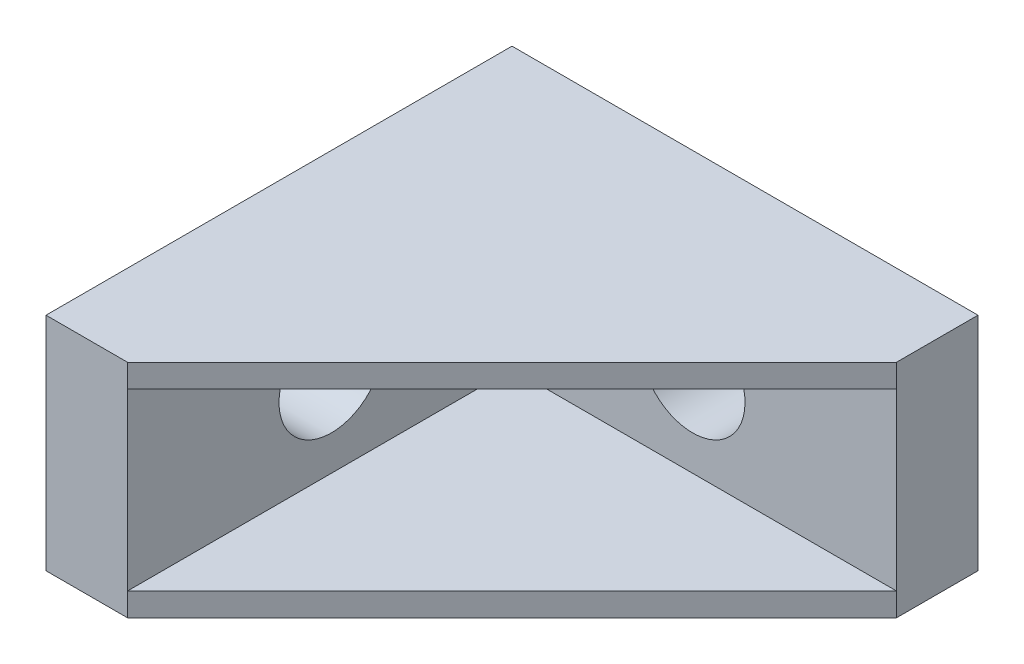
ISO-10303-21;
HEADER;
FILE_DESCRIPTION(('STEP AP214'),'2;1');
FILE_NAME('part.step','',(''),(''),'','','');
FILE_SCHEMA(('AUTOMOTIVE_DESIGN { 1 0 10303 214 1 1 1 1 }'));
ENDSEC;
DATA;
#1=APPLICATION_CONTEXT('core data for automotive mechanical design processes');
#2=APPLICATION_PROTOCOL_DEFINITION('international standard','automotive_design',2000,#1);
#3=PRODUCT_CONTEXT('',#1,'mechanical');
#4=PRODUCT('Part','Part','',(#3));
#5=PRODUCT_RELATED_PRODUCT_CATEGORY('part','',(#4));
#6=PRODUCT_DEFINITION_FORMATION('','',#4);
#7=PRODUCT_DEFINITION_CONTEXT('part definition',#1,'design');
#8=PRODUCT_DEFINITION('design','',#6,#7);
#9=PRODUCT_DEFINITION_SHAPE('','',#8);
#10=(LENGTH_UNIT() NAMED_UNIT(*) SI_UNIT(.MILLI.,.METRE.));
#11=(NAMED_UNIT(*) PLANE_ANGLE_UNIT() SI_UNIT($,.RADIAN.));
#12=(NAMED_UNIT(*) SI_UNIT($,.STERADIAN.) SOLID_ANGLE_UNIT());
#13=UNCERTAINTY_MEASURE_WITH_UNIT(LENGTH_MEASURE(1.E-05),#10,'distance_accuracy_value','');
#14=(GEOMETRIC_REPRESENTATION_CONTEXT(3) GLOBAL_UNCERTAINTY_ASSIGNED_CONTEXT((#13)) GLOBAL_UNIT_ASSIGNED_CONTEXT((#10,
#11,#12)) REPRESENTATION_CONTEXT('',''));
#15=CARTESIAN_POINT('',(0.,0.,0.));
#16=DIRECTION('',(0.,0.,1.));
#17=DIRECTION('',(1.,0.,0.));
#18=AXIS2_PLACEMENT_3D('',#15,#16,#17);
#19=CARTESIAN_POINT('',(15.6482371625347,7.5,15.6482371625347));
#20=DIRECTION('',(0.,-1.,0.));
#21=DIRECTION('',(0.,0.,-1.));
#22=AXIS2_PLACEMENT_3D('',#19,#20,#21);
#23=PLANE('',#22);
#24=DIRECTION('',(-1.,0.,0.));
#25=VECTOR('',#24,1.);
#26=CARTESIAN_POINT('',(20.,7.5,7.));
#27=LINE('',#26,#25);
#28=CARTESIAN_POINT('',(7.,7.5,7.));
#29=VERTEX_POINT('',#28);
#30=CARTESIAN_POINT('',(40.,7.5,7.));
#31=VERTEX_POINT('',#30);
#32=EDGE_CURVE('E85',#29,#31,#27,.F.);
#33=ORIENTED_EDGE('',*,*,#32,.T.);
#34=DIRECTION('',(0.707106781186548,0.,-0.707106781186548));
#35=VECTOR('',#34,1.);
#36=CARTESIAN_POINT('',(7.,7.5,40.));
#37=LINE('',#36,#35);
#38=CARTESIAN_POINT('',(7.,7.5,40.));
#39=VERTEX_POINT('',#38);
#40=EDGE_CURVE('E88',#39,#31,#37,.T.);
#41=ORIENTED_EDGE('',*,*,#40,.F.);
#42=DIRECTION('',(0.,0.,1.));
#43=VECTOR('',#42,1.);
#44=CARTESIAN_POINT('',(7.,7.5,20.));
#45=LINE('',#44,#43);
#46=EDGE_CURVE('E84',#39,#29,#45,.F.);
#47=ORIENTED_EDGE('',*,*,#46,.T.);
#48=EDGE_LOOP('',(#33,#41,#47));
#49=FACE_BOUND('',#48,.T.);
#50=ADVANCED_FACE('F16',(#49),#23,.T.);
#51=CARTESIAN_POINT('',(22.5,0.,3.5));
#52=DIRECTION('',(0.,0.,-1.));
#53=DIRECTION('',(0.,1.,0.));
#54=AXIS2_PLACEMENT_3D('',#51,#52,#53);
#55=CYLINDRICAL_SURFACE('',#54,4.5);
#56=CARTESIAN_POINT('',(22.5,0.,7.));
#57=DIRECTION('',(0.,0.,-1.));
#58=DIRECTION('',(0.,1.,0.));
#59=AXIS2_PLACEMENT_3D('',#56,#57,#58);
#60=CIRCLE('',#59,4.5);
#61=CARTESIAN_POINT('',(22.5,4.5,7.));
#62=VERTEX_POINT('',#61);
#63=EDGE_CURVE('E19',#62,#62,#60,.F.);
#64=ORIENTED_EDGE('',*,*,#63,.T.);
#65=EDGE_LOOP('',(#64));
#66=FACE_BOUND('',#65,.T.);
#67=CARTESIAN_POINT('',(22.5,0.,0.));
#68=DIRECTION('',(0.,0.,-1.));
#69=DIRECTION('',(0.,1.,0.));
#70=AXIS2_PLACEMENT_3D('',#67,#68,#69);
#71=CIRCLE('',#70,4.5);
#72=CARTESIAN_POINT('',(22.5,4.5,0.));
#73=VERTEX_POINT('',#72);
#74=EDGE_CURVE('E113',#73,#73,#71,.T.);
#75=ORIENTED_EDGE('',*,*,#74,.T.);
#76=EDGE_LOOP('',(#75));
#77=FACE_BOUND('',#76,.T.);
#78=ADVANCED_FACE('F270',(#66,#77),#55,.F.);
#79=CARTESIAN_POINT('',(20.,0.,7.));
#80=DIRECTION('',(0.,0.,-1.));
#81=DIRECTION('',(-1.,0.,0.));
#82=AXIS2_PLACEMENT_3D('',#79,#80,#81);
#83=PLANE('',#82);
#84=ORIENTED_EDGE('',*,*,#63,.F.);
#85=EDGE_LOOP('',(#84));
#86=FACE_BOUND('',#85,.T.);
#87=DIRECTION('',(0.,1.,0.));
#88=VECTOR('',#87,1.);
#89=CARTESIAN_POINT('',(40.,0.,7.));
#90=LINE('',#89,#88);
#91=CARTESIAN_POINT('',(40.,-7.5,7.));
#92=VERTEX_POINT('',#91);
#93=EDGE_CURVE('E96',#92,#31,#90,.T.);
#94=ORIENTED_EDGE('',*,*,#93,.T.);
#95=ORIENTED_EDGE('',*,*,#32,.F.);
#96=DIRECTION('',(0.,1.,0.));
#97=VECTOR('',#96,1.);
#98=CARTESIAN_POINT('',(7.,0.,7.));
#99=LINE('',#98,#97);
#100=CARTESIAN_POINT('',(7.,-7.5,7.));
#101=VERTEX_POINT('',#100);
#102=EDGE_CURVE('E79',#29,#101,#99,.F.);
#103=ORIENTED_EDGE('',*,*,#102,.T.);
#104=DIRECTION('',(1.,0.,0.));
#105=VECTOR('',#104,1.);
#106=CARTESIAN_POINT('',(15.6482371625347,-7.5,7.));
#107=LINE('',#106,#105);
#108=EDGE_CURVE('E107',#101,#92,#107,.T.);
#109=ORIENTED_EDGE('',*,*,#108,.T.);
#110=EDGE_LOOP('',(#94,#95,#103,#109));
#111=FACE_BOUND('',#110,.T.);
#112=ADVANCED_FACE('F94',(#86,#111),#83,.F.);
#113=CARTESIAN_POINT('',(15.6482371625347,-7.5,15.6482371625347));
#114=DIRECTION('',(0.,-1.,0.));
#115=DIRECTION('',(0.,0.,-1.));
#116=AXIS2_PLACEMENT_3D('',#113,#114,#115);
#117=PLANE('',#116);
#118=DIRECTION('',(0.707106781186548,0.,-0.707106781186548));
#119=VECTOR('',#118,1.);
#120=CARTESIAN_POINT('',(7.,-7.5,40.));
#121=LINE('',#120,#119);
#122=CARTESIAN_POINT('',(7.,-7.5,40.));
#123=VERTEX_POINT('',#122);
#124=EDGE_CURVE('E135',#92,#123,#121,.F.);
#125=ORIENTED_EDGE('',*,*,#124,.F.);
#126=ORIENTED_EDGE('',*,*,#108,.F.);
#127=DIRECTION('',(0.,0.,1.));
#128=VECTOR('',#127,1.);
#129=CARTESIAN_POINT('',(7.,-7.5,20.));
#130=LINE('',#129,#128);
#131=EDGE_CURVE('E100',#101,#123,#130,.T.);
#132=ORIENTED_EDGE('',*,*,#131,.T.);
#133=EDGE_LOOP('',(#125,#126,#132));
#134=FACE_BOUND('',#133,.T.);
#135=ADVANCED_FACE('F171',(#134),#117,.F.);
#136=CARTESIAN_POINT('',(7.,9.5,40.));
#137=DIRECTION('',(0.707106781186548,0.,0.707106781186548));
#138=DIRECTION('',(0.707106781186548,0.,-0.707106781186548));
#139=AXIS2_PLACEMENT_3D('',#136,#137,#138);
#140=PLANE('',#139);
#141=DIRECTION('',(-0.707106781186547,0.,0.707106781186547));
#142=VECTOR('',#141,1.);
#143=CARTESIAN_POINT('',(40.,9.5,7.));
#144=LINE('',#143,#142);
#145=CARTESIAN_POINT('',(40.,9.5,6.99999999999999));
#146=VERTEX_POINT('',#145);
#147=CARTESIAN_POINT('',(7.,9.5,40.));
#148=VERTEX_POINT('',#147);
#149=EDGE_CURVE('E102',#146,#148,#144,.T.);
#150=ORIENTED_EDGE('',*,*,#149,.T.);
#151=DIRECTION('',(0.,1.,0.));
#152=VECTOR('',#151,1.);
#153=CARTESIAN_POINT('',(7.,0.,40.));
#154=LINE('',#153,#152);
#155=EDGE_CURVE('E142',#148,#39,#154,.F.);
#156=ORIENTED_EDGE('',*,*,#155,.T.);
#157=ORIENTED_EDGE('',*,*,#40,.T.);
#158=DIRECTION('',(0.,1.,0.));
#159=VECTOR('',#158,1.);
#160=CARTESIAN_POINT('',(40.,0.,7.));
#161=LINE('',#160,#159);
#162=EDGE_CURVE('E126',#31,#146,#161,.T.);
#163=ORIENTED_EDGE('',*,*,#162,.T.);
#164=EDGE_LOOP('',(#150,#156,#157,#163));
#165=FACE_BOUND('',#164,.T.);
#166=ADVANCED_FACE('F178',(#165),#140,.T.);
#167=CARTESIAN_POINT('',(7.,0.,20.));
#168=DIRECTION('',(-1.,0.,0.));
#169=DIRECTION('',(0.,0.,1.));
#170=AXIS2_PLACEMENT_3D('',#167,#168,#169);
#171=PLANE('',#170);
#172=CARTESIAN_POINT('',(7.,0.,22.5));
#173=DIRECTION('',(1.,0.,0.));
#174=DIRECTION('',(0.,0.,-1.));
#175=AXIS2_PLACEMENT_3D('',#172,#173,#174);
#176=CIRCLE('',#175,4.5);
#177=CARTESIAN_POINT('',(7.,0.,18.));
#178=VERTEX_POINT('',#177);
#179=EDGE_CURVE('E116',#178,#178,#176,.F.);
#180=ORIENTED_EDGE('',*,*,#179,.T.);
#181=EDGE_LOOP('',(#180));
#182=FACE_BOUND('',#181,.T.);
#183=ORIENTED_EDGE('',*,*,#102,.F.);
#184=ORIENTED_EDGE('',*,*,#46,.F.);
#185=DIRECTION('',(0.,1.,0.));
#186=VECTOR('',#185,1.);
#187=CARTESIAN_POINT('',(7.,0.,40.));
#188=LINE('',#187,#186);
#189=EDGE_CURVE('E144',#39,#123,#188,.F.);
#190=ORIENTED_EDGE('',*,*,#189,.T.);
#191=ORIENTED_EDGE('',*,*,#131,.F.);
#192=EDGE_LOOP('',(#183,#184,#190,#191));
#193=FACE_BOUND('',#192,.T.);
#194=ADVANCED_FACE('F99',(#182,#193),#171,.F.);
#195=CARTESIAN_POINT('',(20.,9.5,3.5));
#196=DIRECTION('',(0.,-1.,0.));
#197=DIRECTION('',(0.,0.,-1.));
#198=AXIS2_PLACEMENT_3D('',#195,#196,#197);
#199=PLANE('',#198);
#200=DIRECTION('',(1.,0.,0.));
#201=VECTOR('',#200,1.);
#202=CARTESIAN_POINT('',(20.,9.5,0.));
#203=LINE('',#202,#201);
#204=CARTESIAN_POINT('',(40.,9.5,0.));
#205=VERTEX_POINT('',#204);
#206=CARTESIAN_POINT('',(0.,9.5,0.));
#207=VERTEX_POINT('',#206);
#208=EDGE_CURVE('E115',#205,#207,#203,.F.);
#209=ORIENTED_EDGE('',*,*,#208,.T.);
#210=DIRECTION('',(0.,0.,-1.));
#211=VECTOR('',#210,1.);
#212=CARTESIAN_POINT('',(0.,9.5,3.5));
#213=LINE('',#212,#211);
#214=CARTESIAN_POINT('',(0.,9.5,40.));
#215=VERTEX_POINT('',#214);
#216=EDGE_CURVE('E149',#207,#215,#213,.F.);
#217=ORIENTED_EDGE('',*,*,#216,.T.);
#218=DIRECTION('',(-1.,0.,0.));
#219=VECTOR('',#218,1.);
#220=CARTESIAN_POINT('',(3.5,9.5,40.));
#221=LINE('',#220,#219);
#222=EDGE_CURVE('E140',#215,#148,#221,.F.);
#223=ORIENTED_EDGE('',*,*,#222,.T.);
#224=ORIENTED_EDGE('',*,*,#149,.F.);
#225=DIRECTION('',(0.,0.,1.));
#226=VECTOR('',#225,1.);
#227=CARTESIAN_POINT('',(40.,9.5,3.5));
#228=LINE('',#227,#226);
#229=EDGE_CURVE('E128',#146,#205,#228,.F.);
#230=ORIENTED_EDGE('',*,*,#229,.T.);
#231=EDGE_LOOP('',(#209,#217,#223,#224,#230));
#232=FACE_BOUND('',#231,.T.);
#233=ADVANCED_FACE('F180',(#232),#199,.F.);
#234=CARTESIAN_POINT('',(3.5,0.,22.5));
#235=DIRECTION('',(1.,0.,0.));
#236=DIRECTION('',(0.,0.,-1.));
#237=AXIS2_PLACEMENT_3D('',#234,#235,#236);
#238=CYLINDRICAL_SURFACE('',#237,4.5);
#239=CARTESIAN_POINT('',(0.,0.,22.5));
#240=DIRECTION('',(1.,0.,0.));
#241=DIRECTION('',(0.,0.,-1.));
#242=AXIS2_PLACEMENT_3D('',#239,#240,#241);
#243=CIRCLE('',#242,4.5);
#244=CARTESIAN_POINT('',(0.,0.,18.));
#245=VERTEX_POINT('',#244);
#246=EDGE_CURVE('E109',#245,#245,#243,.F.);
#247=ORIENTED_EDGE('',*,*,#246,.T.);
#248=EDGE_LOOP('',(#247));
#249=FACE_BOUND('',#248,.T.);
#250=ORIENTED_EDGE('',*,*,#179,.F.);
#251=EDGE_LOOP('',(#250));
#252=FACE_BOUND('',#251,.T.);
#253=ADVANCED_FACE('F189',(#249,#252),#238,.F.);
#254=CARTESIAN_POINT('',(20.,0.,0.));
#255=DIRECTION('',(0.,0.,1.));
#256=DIRECTION('',(1.,0.,0.));
#257=AXIS2_PLACEMENT_3D('',#254,#255,#256);
#258=PLANE('',#257);
#259=ORIENTED_EDGE('',*,*,#74,.F.);
#260=EDGE_LOOP('',(#259));
#261=FACE_BOUND('',#260,.T.);
#262=ORIENTED_EDGE('',*,*,#208,.F.);
#263=DIRECTION('',(0.,1.,0.));
#264=VECTOR('',#263,1.);
#265=CARTESIAN_POINT('',(40.,0.,0.));
#266=LINE('',#265,#264);
#267=CARTESIAN_POINT('',(40.,-9.5,0.));
#268=VERTEX_POINT('',#267);
#269=EDGE_CURVE('E130',#205,#268,#266,.F.);
#270=ORIENTED_EDGE('',*,*,#269,.T.);
#271=DIRECTION('',(1.,0.,0.));
#272=VECTOR('',#271,1.);
#273=CARTESIAN_POINT('',(20.,-9.5,0.));
#274=LINE('',#273,#272);
#275=CARTESIAN_POINT('',(0.,-9.5,0.));
#276=VERTEX_POINT('',#275);
#277=EDGE_CURVE('E112',#276,#268,#274,.T.);
#278=ORIENTED_EDGE('',*,*,#277,.F.);
#279=DIRECTION('',(0.,1.,0.));
#280=VECTOR('',#279,1.);
#281=CARTESIAN_POINT('',(0.,0.,0.));
#282=LINE('',#281,#280);
#283=EDGE_CURVE('E146',#276,#207,#282,.T.);
#284=ORIENTED_EDGE('',*,*,#283,.T.);
#285=EDGE_LOOP('',(#262,#270,#278,#284));
#286=FACE_BOUND('',#285,.T.);
#287=ADVANCED_FACE('F187',(#261,#286),#258,.F.);
#288=CARTESIAN_POINT('',(40.,0.,3.5));
#289=DIRECTION('',(-1.,0.,0.));
#290=DIRECTION('',(0.,0.,1.));
#291=AXIS2_PLACEMENT_3D('',#288,#289,#290);
#292=PLANE('',#291);
#293=ORIENTED_EDGE('',*,*,#229,.F.);
#294=ORIENTED_EDGE('',*,*,#162,.F.);
#295=ORIENTED_EDGE('',*,*,#93,.F.);
#296=DIRECTION('',(0.,1.,0.));
#297=VECTOR('',#296,1.);
#298=CARTESIAN_POINT('',(40.,-7.5,6.99999999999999));
#299=LINE('',#298,#297);
#300=CARTESIAN_POINT('',(40.,-9.5,7.));
#301=VERTEX_POINT('',#300);
#302=EDGE_CURVE('E132',#301,#92,#299,.T.);
#303=ORIENTED_EDGE('',*,*,#302,.F.);
#304=DIRECTION('',(0.,0.,-1.));
#305=VECTOR('',#304,1.);
#306=CARTESIAN_POINT('',(40.,-9.5,3.5));
#307=LINE('',#306,#305);
#308=EDGE_CURVE('E154',#268,#301,#307,.F.);
#309=ORIENTED_EDGE('',*,*,#308,.F.);
#310=ORIENTED_EDGE('',*,*,#269,.F.);
#311=EDGE_LOOP('',(#293,#294,#295,#303,#309,#310));
#312=FACE_BOUND('',#311,.T.);
#313=ADVANCED_FACE('F175',(#312),#292,.F.);
#314=CARTESIAN_POINT('',(7.,-7.5,40.));
#315=DIRECTION('',(0.707106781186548,0.,0.707106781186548));
#316=DIRECTION('',(0.707106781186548,0.,-0.707106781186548));
#317=AXIS2_PLACEMENT_3D('',#314,#315,#316);
#318=PLANE('',#317);
#319=ORIENTED_EDGE('',*,*,#124,.T.);
#320=DIRECTION('',(0.,1.,0.));
#321=VECTOR('',#320,1.);
#322=CARTESIAN_POINT('',(7.,0.,40.));
#323=LINE('',#322,#321);
#324=CARTESIAN_POINT('',(7.,-9.5,40.));
#325=VERTEX_POINT('',#324);
#326=EDGE_CURVE('E138',#123,#325,#323,.F.);
#327=ORIENTED_EDGE('',*,*,#326,.T.);
#328=DIRECTION('',(-0.707106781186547,0.,0.707106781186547));
#329=VECTOR('',#328,1.);
#330=CARTESIAN_POINT('',(40.,-9.5,7.));
#331=LINE('',#330,#329);
#332=EDGE_CURVE('E157',#301,#325,#331,.T.);
#333=ORIENTED_EDGE('',*,*,#332,.F.);
#334=ORIENTED_EDGE('',*,*,#302,.T.);
#335=EDGE_LOOP('',(#319,#327,#333,#334));
#336=FACE_BOUND('',#335,.T.);
#337=ADVANCED_FACE('F168',(#336),#318,.T.);
#338=CARTESIAN_POINT('',(3.5,0.,40.));
#339=DIRECTION('',(0.,0.,-1.));
#340=DIRECTION('',(-1.,0.,0.));
#341=AXIS2_PLACEMENT_3D('',#338,#339,#340);
#342=PLANE('',#341);
#343=ORIENTED_EDGE('',*,*,#155,.F.);
#344=ORIENTED_EDGE('',*,*,#222,.F.);
#345=DIRECTION('',(0.,1.,0.));
#346=VECTOR('',#345,1.);
#347=CARTESIAN_POINT('',(0.,0.,40.));
#348=LINE('',#347,#346);
#349=CARTESIAN_POINT('',(0.,-9.5,40.));
#350=VERTEX_POINT('',#349);
#351=EDGE_CURVE('E34',#215,#350,#348,.F.);
#352=ORIENTED_EDGE('',*,*,#351,.T.);
#353=DIRECTION('',(1.,0.,0.));
#354=VECTOR('',#353,1.);
#355=CARTESIAN_POINT('',(20.,-9.5,40.));
#356=LINE('',#355,#354);
#357=EDGE_CURVE('E25',#325,#350,#356,.F.);
#358=ORIENTED_EDGE('',*,*,#357,.F.);
#359=ORIENTED_EDGE('',*,*,#326,.F.);
#360=ORIENTED_EDGE('',*,*,#189,.F.);
#361=EDGE_LOOP('',(#343,#344,#352,#358,#359,#360));
#362=FACE_BOUND('',#361,.T.);
#363=ADVANCED_FACE('F166',(#362),#342,.F.);
#364=CARTESIAN_POINT('',(0.,0.,3.5));
#365=DIRECTION('',(1.,0.,0.));
#366=DIRECTION('',(0.,0.,-1.));
#367=AXIS2_PLACEMENT_3D('',#364,#365,#366);
#368=PLANE('',#367);
#369=ORIENTED_EDGE('',*,*,#246,.F.);
#370=EDGE_LOOP('',(#369));
#371=FACE_BOUND('',#370,.T.);
#372=ORIENTED_EDGE('',*,*,#216,.F.);
#373=ORIENTED_EDGE('',*,*,#283,.F.);
#374=DIRECTION('',(0.,0.,-1.));
#375=VECTOR('',#374,1.);
#376=CARTESIAN_POINT('',(0.,-9.5,3.5));
#377=LINE('',#376,#375);
#378=EDGE_CURVE('E11',#350,#276,#377,.T.);
#379=ORIENTED_EDGE('',*,*,#378,.F.);
#380=ORIENTED_EDGE('',*,*,#351,.F.);
#381=EDGE_LOOP('',(#372,#373,#379,#380));
#382=FACE_BOUND('',#381,.T.);
#383=ADVANCED_FACE('F184',(#371,#382),#368,.F.);
#384=CARTESIAN_POINT('',(20.,-9.5,3.5));
#385=DIRECTION('',(0.,-1.,0.));
#386=DIRECTION('',(0.,0.,-1.));
#387=AXIS2_PLACEMENT_3D('',#384,#385,#386);
#388=PLANE('',#387);
#389=ORIENTED_EDGE('',*,*,#357,.T.);
#390=ORIENTED_EDGE('',*,*,#378,.T.);
#391=ORIENTED_EDGE('',*,*,#277,.T.);
#392=ORIENTED_EDGE('',*,*,#308,.T.);
#393=ORIENTED_EDGE('',*,*,#332,.T.);
#394=EDGE_LOOP('',(#389,#390,#391,#392,#393));
#395=FACE_BOUND('',#394,.T.);
#396=ADVANCED_FACE('F162',(#395),#388,.T.);
#397=CLOSED_SHELL('',(#50,#78,#112,#135,#166,#194,#233,#253,#287,#313,#337,#363,#383,#396));
#398=MANIFOLD_SOLID_BREP('B1',#397);
#399=ADVANCED_BREP_SHAPE_REPRESENTATION('',(#18,#398),#14);
#400=SHAPE_DEFINITION_REPRESENTATION(#9,#399);
ENDSEC;
END-ISO-10303-21;
